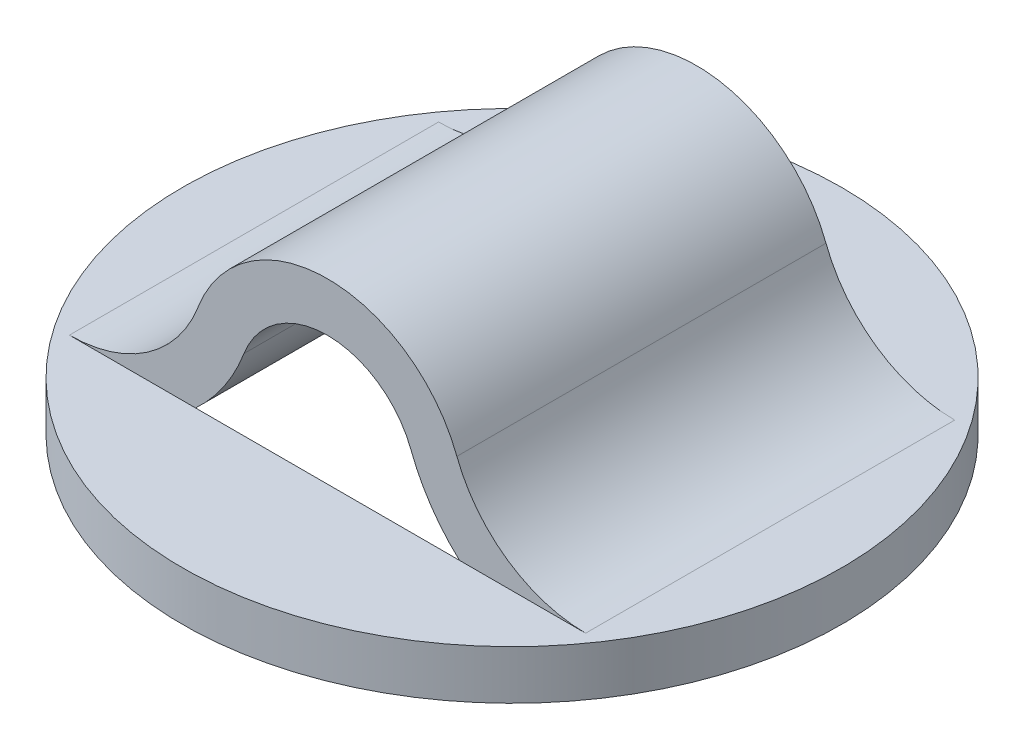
ISO-10303-21;
HEADER;
FILE_DESCRIPTION(('STEP AP214'),'2;1');
FILE_NAME('part.step','',(''),(''),'','','');
FILE_SCHEMA(('AUTOMOTIVE_DESIGN { 1 0 10303 214 1 1 1 1 }'));
ENDSEC;
DATA;
#1=APPLICATION_CONTEXT('core data for automotive mechanical design processes');
#2=APPLICATION_PROTOCOL_DEFINITION('international standard','automotive_design',2000,#1);
#3=PRODUCT_CONTEXT('',#1,'mechanical');
#4=PRODUCT('Part','Part','',(#3));
#5=PRODUCT_RELATED_PRODUCT_CATEGORY('part','',(#4));
#6=PRODUCT_DEFINITION_FORMATION('','',#4);
#7=PRODUCT_DEFINITION_CONTEXT('part definition',#1,'design');
#8=PRODUCT_DEFINITION('design','',#6,#7);
#9=PRODUCT_DEFINITION_SHAPE('','',#8);
#10=(LENGTH_UNIT() NAMED_UNIT(*) SI_UNIT(.MILLI.,.METRE.));
#11=(NAMED_UNIT(*) PLANE_ANGLE_UNIT() SI_UNIT($,.RADIAN.));
#12=(NAMED_UNIT(*) SI_UNIT($,.STERADIAN.) SOLID_ANGLE_UNIT());
#13=UNCERTAINTY_MEASURE_WITH_UNIT(LENGTH_MEASURE(1.E-05),#10,'distance_accuracy_value','');
#14=(GEOMETRIC_REPRESENTATION_CONTEXT(3) GLOBAL_UNCERTAINTY_ASSIGNED_CONTEXT((#13)) GLOBAL_UNIT_ASSIGNED_CONTEXT((#10,
#11,#12)) REPRESENTATION_CONTEXT('',''));
#15=CARTESIAN_POINT('',(0.,0.,0.));
#16=DIRECTION('',(0.,0.,1.));
#17=DIRECTION('',(1.,0.,0.));
#18=AXIS2_PLACEMENT_3D('',#15,#16,#17);
#19=CARTESIAN_POINT('',(0.,1.905,17.78));
#20=DIRECTION('',(0.,0.,-1.));
#21=DIRECTION('',(-1.,0.,0.));
#22=AXIS2_PLACEMENT_3D('',#19,#20,#21);
#23=CYLINDRICAL_SURFACE('',#22,6.6675);
#24=CARTESIAN_POINT('',(0.,1.905,0.));
#25=DIRECTION('',(0.,0.,-1.));
#26=DIRECTION('',(-1.,0.,0.));
#27=AXIS2_PLACEMENT_3D('',#24,#25,#26);
#28=CIRCLE('',#27,6.6675);
#29=CARTESIAN_POINT('',(-6.23167867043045,4.27602028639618,0.));
#30=VERTEX_POINT('',#29);
#31=CARTESIAN_POINT('',(6.23167867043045,4.27602028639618,0.));
#32=VERTEX_POINT('',#31);
#33=EDGE_CURVE('E93',#30,#32,#28,.T.);
#34=ORIENTED_EDGE('',*,*,#33,.F.);
#35=DIRECTION('',(0.,0.,-1.));
#36=VECTOR('',#35,1.);
#37=CARTESIAN_POINT('',(-6.23167867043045,4.27602028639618,17.78));
#38=LINE('',#37,#36);
#39=CARTESIAN_POINT('',(-6.23167867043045,4.27602028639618,17.78));
#40=VERTEX_POINT('',#39);
#41=EDGE_CURVE('E99',#30,#40,#38,.F.);
#42=ORIENTED_EDGE('',*,*,#41,.T.);
#43=CARTESIAN_POINT('',(0.,1.905,17.78));
#44=DIRECTION('',(0.,0.,-1.));
#45=DIRECTION('',(-1.,0.,0.));
#46=AXIS2_PLACEMENT_3D('',#43,#44,#45);
#47=CIRCLE('',#46,6.6675);
#48=CARTESIAN_POINT('',(6.23167867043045,4.27602028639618,17.78));
#49=VERTEX_POINT('',#48);
#50=EDGE_CURVE('E95',#40,#49,#47,.T.);
#51=ORIENTED_EDGE('',*,*,#50,.T.);
#52=DIRECTION('',(0.,0.,-1.));
#53=VECTOR('',#52,1.);
#54=CARTESIAN_POINT('',(6.23167867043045,4.27602028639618,17.78));
#55=LINE('',#54,#53);
#56=EDGE_CURVE('E91',#49,#32,#55,.T.);
#57=ORIENTED_EDGE('',*,*,#56,.T.);
#58=EDGE_LOOP('',(#34,#42,#51,#57));
#59=FACE_BOUND('',#58,.T.);
#60=ADVANCED_FACE('F18',(#59),#23,.T.);
#61=CARTESIAN_POINT('',(12.4336826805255,6.63575,17.78));
#62=DIRECTION('',(0.,0.,-1.));
#63=DIRECTION('',(-1.,0.,0.));
#64=AXIS2_PLACEMENT_3D('',#61,#62,#63);
#65=CYLINDRICAL_SURFACE('',#64,6.63575);
#66=CARTESIAN_POINT('',(12.4336826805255,6.63575,17.78));
#67=DIRECTION('',(0.,0.,-1.));
#68=DIRECTION('',(-1.,0.,0.));
#69=AXIS2_PLACEMENT_3D('',#66,#67,#68);
#70=CIRCLE('',#69,6.63575);
#71=CARTESIAN_POINT('',(12.4336826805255,0.,17.78));
#72=VERTEX_POINT('',#71);
#73=EDGE_CURVE('E154',#49,#72,#70,.F.);
#74=ORIENTED_EDGE('',*,*,#73,.T.);
#75=DIRECTION('',(0.,0.,1.));
#76=VECTOR('',#75,1.);
#77=CARTESIAN_POINT('',(12.4336826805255,0.,17.78));
#78=LINE('',#77,#76);
#79=CARTESIAN_POINT('',(12.4336826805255,0.,0.));
#80=VERTEX_POINT('',#79);
#81=EDGE_CURVE('E113',#72,#80,#78,.F.);
#82=ORIENTED_EDGE('',*,*,#81,.T.);
#83=CARTESIAN_POINT('',(12.4336826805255,6.63575,0.));
#84=DIRECTION('',(0.,0.,-1.));
#85=DIRECTION('',(-1.,0.,0.));
#86=AXIS2_PLACEMENT_3D('',#83,#84,#85);
#87=CIRCLE('',#86,6.63575);
#88=EDGE_CURVE('E21',#32,#80,#87,.F.);
#89=ORIENTED_EDGE('',*,*,#88,.F.);
#90=ORIENTED_EDGE('',*,*,#56,.F.);
#91=EDGE_LOOP('',(#74,#82,#89,#90));
#92=FACE_BOUND('',#91,.T.);
#93=ADVANCED_FACE('F111',(#92),#65,.F.);
#94=CARTESIAN_POINT('',(-12.4336826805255,6.63575,17.78));
#95=DIRECTION('',(0.,0.,-1.));
#96=DIRECTION('',(-1.,0.,0.));
#97=AXIS2_PLACEMENT_3D('',#94,#95,#96);
#98=CYLINDRICAL_SURFACE('',#97,6.63575);
#99=CARTESIAN_POINT('',(-12.4336826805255,6.63575,17.78));
#100=DIRECTION('',(0.,0.,-1.));
#101=DIRECTION('',(-1.,0.,0.));
#102=AXIS2_PLACEMENT_3D('',#99,#100,#101);
#103=CIRCLE('',#102,6.63575);
#104=CARTESIAN_POINT('',(-12.4336826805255,0.,17.78));
#105=VERTEX_POINT('',#104);
#106=EDGE_CURVE('E108',#105,#40,#103,.F.);
#107=ORIENTED_EDGE('',*,*,#106,.T.);
#108=ORIENTED_EDGE('',*,*,#41,.F.);
#109=CARTESIAN_POINT('',(-12.4336826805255,6.63575,0.));
#110=DIRECTION('',(0.,0.,-1.));
#111=DIRECTION('',(-1.,0.,0.));
#112=AXIS2_PLACEMENT_3D('',#109,#110,#111);
#113=CIRCLE('',#112,6.63575);
#114=CARTESIAN_POINT('',(-12.4336826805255,0.,0.));
#115=VERTEX_POINT('',#114);
#116=EDGE_CURVE('E107',#115,#30,#113,.F.);
#117=ORIENTED_EDGE('',*,*,#116,.F.);
#118=DIRECTION('',(0.,0.,1.));
#119=VECTOR('',#118,1.);
#120=CARTESIAN_POINT('',(-12.4336826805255,0.,17.78));
#121=LINE('',#120,#119);
#122=EDGE_CURVE('E162',#115,#105,#121,.T.);
#123=ORIENTED_EDGE('',*,*,#122,.T.);
#124=EDGE_LOOP('',(#107,#108,#117,#123));
#125=FACE_BOUND('',#124,.T.);
#126=ADVANCED_FACE('F160',(#125),#98,.F.);
#127=CARTESIAN_POINT('',(-12.4336826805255,6.63575,0.));
#128=DIRECTION('',(0.,0.,-1.));
#129=DIRECTION('',(-1.,0.,0.));
#130=AXIS2_PLACEMENT_3D('',#127,#128,#129);
#131=PLANE('',#130);
#132=ORIENTED_EDGE('',*,*,#116,.T.);
#133=ORIENTED_EDGE('',*,*,#33,.T.);
#134=ORIENTED_EDGE('',*,*,#88,.T.);
#135=DIRECTION('',(1.,0.,0.));
#136=VECTOR('',#135,1.);
#137=CARTESIAN_POINT('',(12.4336826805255,0.,0.));
#138=LINE('',#137,#136);
#139=CARTESIAN_POINT('',(6.35668291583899,0.,0.));
#140=VERTEX_POINT('',#139);
#141=EDGE_CURVE('E183',#80,#140,#138,.F.);
#142=ORIENTED_EDGE('',*,*,#141,.T.);
#143=CARTESIAN_POINT('',(12.4336826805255,6.63575,0.));
#144=DIRECTION('',(0.,0.,-1.));
#145=DIRECTION('',(-1.,0.,0.));
#146=AXIS2_PLACEMENT_3D('',#143,#144,#145);
#147=CIRCLE('',#146,8.99795);
#148=CARTESIAN_POINT('',(4.02388394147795,3.43600167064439,0.));
#149=VERTEX_POINT('',#148);
#150=EDGE_CURVE('E131',#149,#140,#147,.F.);
#151=ORIENTED_EDGE('',*,*,#150,.F.);
#152=CARTESIAN_POINT('',(0.,1.905,0.));
#153=DIRECTION('',(0.,0.,-1.));
#154=DIRECTION('',(-1.,0.,0.));
#155=AXIS2_PLACEMENT_3D('',#152,#153,#154);
#156=CIRCLE('',#155,4.3053);
#157=CARTESIAN_POINT('',(-4.02388394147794,3.43600167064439,0.));
#158=VERTEX_POINT('',#157);
#159=EDGE_CURVE('E151',#149,#158,#156,.F.);
#160=ORIENTED_EDGE('',*,*,#159,.T.);
#161=CARTESIAN_POINT('',(-12.4336826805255,6.63575,0.));
#162=DIRECTION('',(0.,0.,-1.));
#163=DIRECTION('',(-1.,0.,0.));
#164=AXIS2_PLACEMENT_3D('',#161,#162,#163);
#165=CIRCLE('',#164,8.99795);
#166=CARTESIAN_POINT('',(-6.35668291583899,0.,0.));
#167=VERTEX_POINT('',#166);
#168=EDGE_CURVE('E138',#167,#158,#165,.F.);
#169=ORIENTED_EDGE('',*,*,#168,.F.);
#170=DIRECTION('',(1.,0.,0.));
#171=VECTOR('',#170,1.);
#172=CARTESIAN_POINT('',(12.4336826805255,0.,0.));
#173=LINE('',#172,#171);
#174=EDGE_CURVE('E173',#167,#115,#173,.F.);
#175=ORIENTED_EDGE('',*,*,#174,.T.);
#176=EDGE_LOOP('',(#132,#133,#134,#142,#151,#160,#169,#175));
#177=FACE_BOUND('',#176,.T.);
#178=ADVANCED_FACE('F104',(#177),#131,.T.);
#179=CARTESIAN_POINT('',(-12.4336826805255,6.63575,17.78));
#180=DIRECTION('',(0.,0.,-1.));
#181=DIRECTION('',(-1.,0.,0.));
#182=AXIS2_PLACEMENT_3D('',#179,#180,#181);
#183=PLANE('',#182);
#184=ORIENTED_EDGE('',*,*,#73,.F.);
#185=ORIENTED_EDGE('',*,*,#50,.F.);
#186=ORIENTED_EDGE('',*,*,#106,.F.);
#187=DIRECTION('',(1.,0.,0.));
#188=VECTOR('',#187,1.);
#189=CARTESIAN_POINT('',(12.4336826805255,0.,17.78));
#190=LINE('',#189,#188);
#191=CARTESIAN_POINT('',(-6.35668291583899,0.,17.78));
#192=VERTEX_POINT('',#191);
#193=EDGE_CURVE('E146',#105,#192,#190,.T.);
#194=ORIENTED_EDGE('',*,*,#193,.T.);
#195=CARTESIAN_POINT('',(-12.4336826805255,6.63575,17.78));
#196=DIRECTION('',(0.,0.,-1.));
#197=DIRECTION('',(-1.,0.,0.));
#198=AXIS2_PLACEMENT_3D('',#195,#196,#197);
#199=CIRCLE('',#198,8.99795);
#200=CARTESIAN_POINT('',(-4.02388394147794,3.43600167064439,17.78));
#201=VERTEX_POINT('',#200);
#202=EDGE_CURVE('E141',#201,#192,#199,.T.);
#203=ORIENTED_EDGE('',*,*,#202,.F.);
#204=CARTESIAN_POINT('',(0.,1.905,17.78));
#205=DIRECTION('',(0.,0.,-1.));
#206=DIRECTION('',(-1.,0.,0.));
#207=AXIS2_PLACEMENT_3D('',#204,#205,#206);
#208=CIRCLE('',#207,4.3053);
#209=CARTESIAN_POINT('',(4.02388394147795,3.43600167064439,17.78));
#210=VERTEX_POINT('',#209);
#211=EDGE_CURVE('E147',#201,#210,#208,.T.);
#212=ORIENTED_EDGE('',*,*,#211,.T.);
#213=CARTESIAN_POINT('',(12.4336826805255,6.63575,17.78));
#214=DIRECTION('',(0.,0.,-1.));
#215=DIRECTION('',(-1.,0.,0.));
#216=AXIS2_PLACEMENT_3D('',#213,#214,#215);
#217=CIRCLE('',#216,8.99795);
#218=CARTESIAN_POINT('',(6.35668291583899,0.,17.78));
#219=VERTEX_POINT('',#218);
#220=EDGE_CURVE('E126',#219,#210,#217,.T.);
#221=ORIENTED_EDGE('',*,*,#220,.F.);
#222=DIRECTION('',(1.,0.,0.));
#223=VECTOR('',#222,1.);
#224=CARTESIAN_POINT('',(12.4336826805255,0.,17.78));
#225=LINE('',#224,#223);
#226=EDGE_CURVE('E150',#219,#72,#225,.T.);
#227=ORIENTED_EDGE('',*,*,#226,.T.);
#228=EDGE_LOOP('',(#184,#185,#186,#194,#203,#212,#221,#227));
#229=FACE_BOUND('',#228,.T.);
#230=ADVANCED_FACE('F166',(#229),#183,.F.);
#231=CARTESIAN_POINT('',(0.,1.905,17.78));
#232=DIRECTION('',(0.,0.,-1.));
#233=DIRECTION('',(-1.,0.,0.));
#234=AXIS2_PLACEMENT_3D('',#231,#232,#233);
#235=CYLINDRICAL_SURFACE('',#234,4.3053);
#236=ORIENTED_EDGE('',*,*,#211,.F.);
#237=DIRECTION('',(0.,0.,-1.));
#238=VECTOR('',#237,1.);
#239=CARTESIAN_POINT('',(-4.02388394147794,3.43600167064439,17.78));
#240=LINE('',#239,#238);
#241=EDGE_CURVE('E140',#158,#201,#240,.F.);
#242=ORIENTED_EDGE('',*,*,#241,.F.);
#243=ORIENTED_EDGE('',*,*,#159,.F.);
#244=DIRECTION('',(0.,0.,-1.));
#245=VECTOR('',#244,1.);
#246=CARTESIAN_POINT('',(4.02388394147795,3.43600167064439,17.78));
#247=LINE('',#246,#245);
#248=EDGE_CURVE('E128',#210,#149,#247,.T.);
#249=ORIENTED_EDGE('',*,*,#248,.F.);
#250=EDGE_LOOP('',(#236,#242,#243,#249));
#251=FACE_BOUND('',#250,.T.);
#252=ADVANCED_FACE('F233',(#251),#235,.F.);
#253=CARTESIAN_POINT('',(12.4336826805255,0.,17.78));
#254=DIRECTION('',(0.,-1.,0.));
#255=DIRECTION('',(1.,0.,0.));
#256=AXIS2_PLACEMENT_3D('',#253,#254,#255);
#257=PLANE('',#256);
#258=ORIENTED_EDGE('',*,*,#193,.F.);
#259=ORIENTED_EDGE('',*,*,#122,.F.);
#260=ORIENTED_EDGE('',*,*,#174,.F.);
#261=DIRECTION('',(-1.,0.,0.));
#262=VECTOR('',#261,1.);
#263=CARTESIAN_POINT('',(-12.4336826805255,0.,0.));
#264=LINE('',#263,#262);
#265=EDGE_CURVE('E137',#167,#140,#264,.F.);
#266=ORIENTED_EDGE('',*,*,#265,.T.);
#267=ORIENTED_EDGE('',*,*,#141,.F.);
#268=ORIENTED_EDGE('',*,*,#81,.F.);
#269=ORIENTED_EDGE('',*,*,#226,.F.);
#270=DIRECTION('',(-1.,0.,0.));
#271=VECTOR('',#270,1.);
#272=CARTESIAN_POINT('',(-12.4336826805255,0.,17.78));
#273=LINE('',#272,#271);
#274=EDGE_CURVE('E125',#192,#219,#273,.F.);
#275=ORIENTED_EDGE('',*,*,#274,.F.);
#276=EDGE_LOOP('',(#258,#259,#260,#266,#267,#268,#269,#275));
#277=FACE_BOUND('',#276,.T.);
#278=CARTESIAN_POINT('',(0.,0.,8.89));
#279=DIRECTION('',(0.,-1.,0.));
#280=DIRECTION('',(0.,0.,-1.));
#281=AXIS2_PLACEMENT_3D('',#278,#279,#280);
#282=CIRCLE('',#281,15.875);
#283=CARTESIAN_POINT('',(0.,0.,-6.985));
#284=VERTEX_POINT('',#283);
#285=EDGE_CURVE('E143',#284,#284,#282,.T.);
#286=ORIENTED_EDGE('',*,*,#285,.F.);
#287=EDGE_LOOP('',(#286));
#288=FACE_BOUND('',#287,.T.);
#289=ADVANCED_FACE('F170',(#277,#288),#257,.F.);
#290=CARTESIAN_POINT('',(0.,0.,8.89));
#291=DIRECTION('',(0.,-1.,0.));
#292=DIRECTION('',(0.,0.,-1.));
#293=AXIS2_PLACEMENT_3D('',#290,#291,#292);
#294=CYLINDRICAL_SURFACE('',#293,15.875);
#295=CARTESIAN_POINT('',(0.,-2.3622,8.89));
#296=DIRECTION('',(0.,-1.,0.));
#297=DIRECTION('',(0.,0.,-1.));
#298=AXIS2_PLACEMENT_3D('',#295,#296,#297);
#299=CIRCLE('',#298,15.875);
#300=CARTESIAN_POINT('',(0.,-2.3622,-6.985));
#301=VERTEX_POINT('',#300);
#302=EDGE_CURVE('E117',#301,#301,#299,.F.);
#303=ORIENTED_EDGE('',*,*,#302,.T.);
#304=EDGE_LOOP('',(#303));
#305=FACE_BOUND('',#304,.T.);
#306=ORIENTED_EDGE('',*,*,#285,.T.);
#307=EDGE_LOOP('',(#306));
#308=FACE_BOUND('',#307,.T.);
#309=ADVANCED_FACE('F227',(#305,#308),#294,.T.);
#310=CARTESIAN_POINT('',(-12.4336826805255,6.63575,17.78));
#311=DIRECTION('',(0.,0.,-1.));
#312=DIRECTION('',(-1.,0.,0.));
#313=AXIS2_PLACEMENT_3D('',#310,#311,#312);
#314=CYLINDRICAL_SURFACE('',#313,8.99795);
#315=ORIENTED_EDGE('',*,*,#168,.T.);
#316=ORIENTED_EDGE('',*,*,#241,.T.);
#317=ORIENTED_EDGE('',*,*,#202,.T.);
#318=CARTESIAN_POINT('',(-12.4336826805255,6.63575,17.78));
#319=DIRECTION('',(0.,0.,-1.));
#320=DIRECTION('',(-1.,0.,0.));
#321=AXIS2_PLACEMENT_3D('',#318,#319,#320);
#322=CIRCLE('',#321,8.99795);
#323=CARTESIAN_POINT('',(-12.4336826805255,-2.3622,17.78));
#324=VERTEX_POINT('',#323);
#325=EDGE_CURVE('E121',#324,#192,#322,.F.);
#326=ORIENTED_EDGE('',*,*,#325,.F.);
#327=DIRECTION('',(0.,0.,1.));
#328=VECTOR('',#327,1.);
#329=CARTESIAN_POINT('',(-12.4336826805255,-2.3622,17.78));
#330=LINE('',#329,#328);
#331=CARTESIAN_POINT('',(-12.4336826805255,-2.3622,0.));
#332=VERTEX_POINT('',#331);
#333=EDGE_CURVE('E120',#324,#332,#330,.F.);
#334=ORIENTED_EDGE('',*,*,#333,.T.);
#335=CARTESIAN_POINT('',(-12.4336826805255,6.63575,0.));
#336=DIRECTION('',(0.,0.,-1.));
#337=DIRECTION('',(-1.,0.,0.));
#338=AXIS2_PLACEMENT_3D('',#335,#336,#337);
#339=CIRCLE('',#338,8.99795);
#340=EDGE_CURVE('E134',#332,#167,#339,.F.);
#341=ORIENTED_EDGE('',*,*,#340,.T.);
#342=EDGE_LOOP('',(#315,#316,#317,#326,#334,#341));
#343=FACE_BOUND('',#342,.T.);
#344=ADVANCED_FACE('F211',(#343),#314,.T.);
#345=CARTESIAN_POINT('',(-12.4336826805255,6.63575,0.));
#346=DIRECTION('',(0.,0.,-1.));
#347=DIRECTION('',(-1.,0.,0.));
#348=AXIS2_PLACEMENT_3D('',#345,#346,#347);
#349=PLANE('',#348);
#350=DIRECTION('',(1.,0.,0.));
#351=VECTOR('',#350,1.);
#352=CARTESIAN_POINT('',(-15.875,-2.3622,0.));
#353=LINE('',#352,#351);
#354=CARTESIAN_POINT('',(12.4336826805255,-2.3622,0.));
#355=VERTEX_POINT('',#354);
#356=EDGE_CURVE('E196',#332,#355,#353,.T.);
#357=ORIENTED_EDGE('',*,*,#356,.T.);
#358=CARTESIAN_POINT('',(12.4336826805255,6.63575,0.));
#359=DIRECTION('',(0.,0.,-1.));
#360=DIRECTION('',(-1.,0.,0.));
#361=AXIS2_PLACEMENT_3D('',#358,#359,#360);
#362=CIRCLE('',#361,8.99795);
#363=EDGE_CURVE('E129',#140,#355,#362,.F.);
#364=ORIENTED_EDGE('',*,*,#363,.F.);
#365=ORIENTED_EDGE('',*,*,#265,.F.);
#366=ORIENTED_EDGE('',*,*,#340,.F.);
#367=EDGE_LOOP('',(#357,#364,#365,#366));
#368=FACE_BOUND('',#367,.T.);
#369=ADVANCED_FACE('F194',(#368),#349,.F.);
#370=CARTESIAN_POINT('',(12.4336826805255,6.63575,17.78));
#371=DIRECTION('',(0.,0.,-1.));
#372=DIRECTION('',(-1.,0.,0.));
#373=AXIS2_PLACEMENT_3D('',#370,#371,#372);
#374=CYLINDRICAL_SURFACE('',#373,8.99795);
#375=ORIENTED_EDGE('',*,*,#220,.T.);
#376=ORIENTED_EDGE('',*,*,#248,.T.);
#377=ORIENTED_EDGE('',*,*,#150,.T.);
#378=ORIENTED_EDGE('',*,*,#363,.T.);
#379=DIRECTION('',(0.,0.,1.));
#380=VECTOR('',#379,1.);
#381=CARTESIAN_POINT('',(12.4336826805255,-2.3622,17.78));
#382=LINE('',#381,#380);
#383=CARTESIAN_POINT('',(12.4336826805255,-2.3622,17.78));
#384=VERTEX_POINT('',#383);
#385=EDGE_CURVE('E27',#355,#384,#382,.T.);
#386=ORIENTED_EDGE('',*,*,#385,.T.);
#387=CARTESIAN_POINT('',(12.4336826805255,6.63575,17.78));
#388=DIRECTION('',(0.,0.,-1.));
#389=DIRECTION('',(-1.,0.,0.));
#390=AXIS2_PLACEMENT_3D('',#387,#388,#389);
#391=CIRCLE('',#390,8.99795);
#392=EDGE_CURVE('E35',#219,#384,#391,.F.);
#393=ORIENTED_EDGE('',*,*,#392,.F.);
#394=EDGE_LOOP('',(#375,#376,#377,#378,#386,#393));
#395=FACE_BOUND('',#394,.T.);
#396=ADVANCED_FACE('F200',(#395),#374,.T.);
#397=CARTESIAN_POINT('',(-12.4336826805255,6.63575,17.78));
#398=DIRECTION('',(0.,0.,-1.));
#399=DIRECTION('',(-1.,0.,0.));
#400=AXIS2_PLACEMENT_3D('',#397,#398,#399);
#401=PLANE('',#400);
#402=DIRECTION('',(1.,0.,0.));
#403=VECTOR('',#402,1.);
#404=CARTESIAN_POINT('',(-15.875,-2.3622,17.78));
#405=LINE('',#404,#403);
#406=EDGE_CURVE('E11',#384,#324,#405,.F.);
#407=ORIENTED_EDGE('',*,*,#406,.T.);
#408=ORIENTED_EDGE('',*,*,#325,.T.);
#409=ORIENTED_EDGE('',*,*,#274,.T.);
#410=ORIENTED_EDGE('',*,*,#392,.T.);
#411=EDGE_LOOP('',(#407,#408,#409,#410));
#412=FACE_BOUND('',#411,.T.);
#413=ADVANCED_FACE('F212',(#412),#401,.T.);
#414=CARTESIAN_POINT('',(-15.875,-2.3622,17.78));
#415=DIRECTION('',(0.,1.,0.));
#416=DIRECTION('',(0.,0.,1.));
#417=AXIS2_PLACEMENT_3D('',#414,#415,#416);
#418=PLANE('',#417);
#419=ORIENTED_EDGE('',*,*,#385,.F.);
#420=ORIENTED_EDGE('',*,*,#356,.F.);
#421=ORIENTED_EDGE('',*,*,#333,.F.);
#422=ORIENTED_EDGE('',*,*,#406,.F.);
#423=EDGE_LOOP('',(#419,#420,#421,#422));
#424=FACE_BOUND('',#423,.T.);
#425=ORIENTED_EDGE('',*,*,#302,.F.);
#426=EDGE_LOOP('',(#425));
#427=FACE_BOUND('',#426,.T.);
#428=ADVANCED_FACE('F203',(#424,#427),#418,.F.);
#429=CLOSED_SHELL('',(#60,#93,#126,#178,#230,#252,#289,#309,#344,#369,#396,#413,#428));
#430=MANIFOLD_SOLID_BREP('B1',#429);
#431=ADVANCED_BREP_SHAPE_REPRESENTATION('',(#18,#430),#14);
#432=SHAPE_DEFINITION_REPRESENTATION(#9,#431);
ENDSEC;
END-ISO-10303-21;
